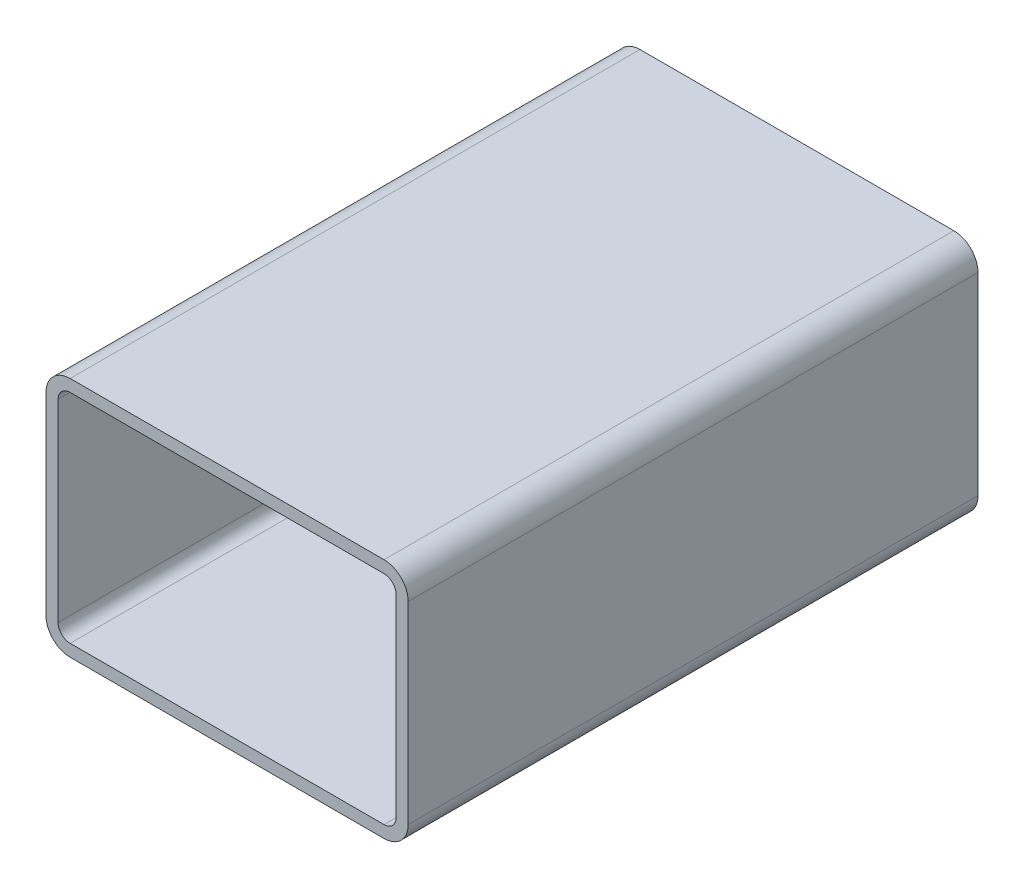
from build123d import *

# Parameters (mm, degrees)
EXTRUSION1_DEPTH = 236


with BuildPart() as part:
    # Esquisse1 → Extrusion1 (new, symmetric)
    with BuildSketch(Plane.XY):
        with BuildLine():
            Line((20.000063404, 3.9007e-05), (280.000063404, 3.9007e-05))
            ThreePointArc((280.000063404, 3.9007e-05), (294.142199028, 5.857903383), (300.000063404, 20.000039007))
            Line((300.000063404, 20.000039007), (300.000063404, 180.000039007))
            ThreePointArc((300.000063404, 180.000039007), (294.142199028, 194.14217463), (280.000063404, 200.000039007))
            Line((280.000063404, 200.000039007), (20.000063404, 200.000039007))
            ThreePointArc((20.000063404, 200.000039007), (5.85792778, 194.14217463), (6.3404e-05, 180.000039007))
            Line((6.3404e-05, 180.000039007), (6.3404e-05, 20.000039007))
            ThreePointArc((6.3404e-05, 20.000039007), (5.85792778, 5.857903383), (20.000063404, 3.9007e-05))
        make_face()
        with BuildLine():
            Line((20.000063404, 10.000039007), (280.000063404, 10.000039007))
            ThreePointArc((280.000063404, 10.000039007), (287.071131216, 12.928971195), (290.000063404, 20.000039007))
            Line((290.000063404, 20.000039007), (290.000063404, 180.000039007))
            ThreePointArc((290.000063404, 180.000039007), (287.071131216, 187.071106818), (280.000063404, 190.000039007))
            Line((280.000063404, 190.000039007), (20.000063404, 190.000039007))
            ThreePointArc((20.000063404, 190.000039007), (12.928995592, 187.071106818), (10.000063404, 180.000039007))
            Line((10.000063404, 180.000039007), (10.000063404, 20.000039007))
            ThreePointArc((10.000063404, 20.000039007), (12.928995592, 12.928971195), (20.000063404, 10.000039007))
        make_face(mode=Mode.SUBTRACT)
    extrude(amount=EXTRUSION1_DEPTH, both=True)


solid = part.part
